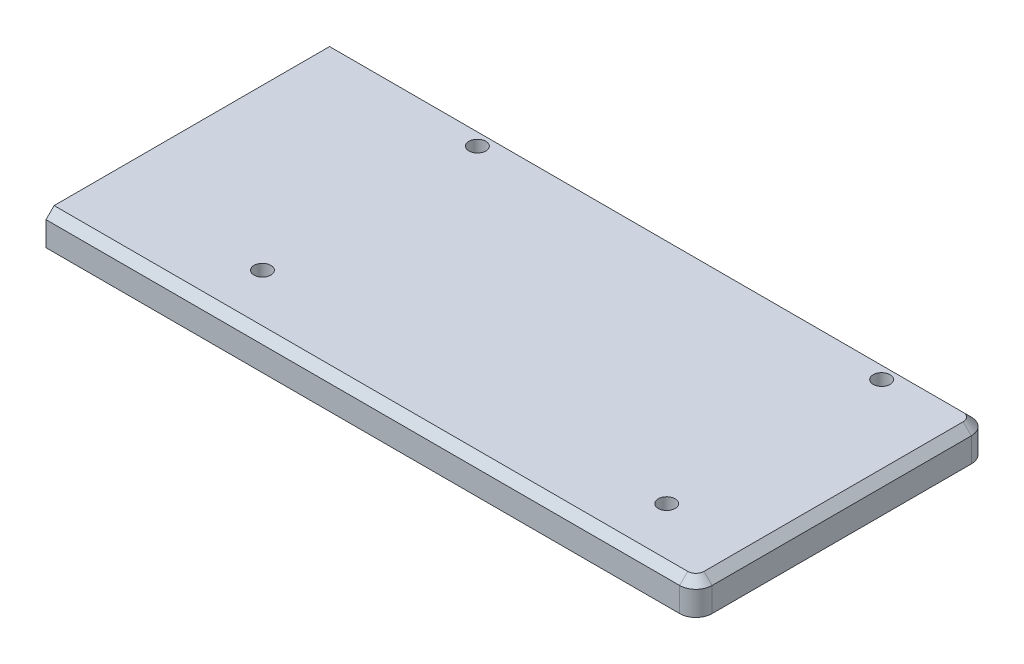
ISO-10303-21;
HEADER;
FILE_DESCRIPTION(('STEP AP214'),'2;1');
FILE_NAME('part.step','',(''),(''),'','','');
FILE_SCHEMA(('AUTOMOTIVE_DESIGN { 1 0 10303 214 1 1 1 1 }'));
ENDSEC;
DATA;
#1=APPLICATION_CONTEXT('core data for automotive mechanical design processes');
#2=APPLICATION_PROTOCOL_DEFINITION('international standard','automotive_design',2000,#1);
#3=PRODUCT_CONTEXT('',#1,'mechanical');
#4=PRODUCT('Part','Part','',(#3));
#5=PRODUCT_RELATED_PRODUCT_CATEGORY('part','',(#4));
#6=PRODUCT_DEFINITION_FORMATION('','',#4);
#7=PRODUCT_DEFINITION_CONTEXT('part definition',#1,'design');
#8=PRODUCT_DEFINITION('design','',#6,#7);
#9=PRODUCT_DEFINITION_SHAPE('','',#8);
#10=(LENGTH_UNIT() NAMED_UNIT(*) SI_UNIT(.MILLI.,.METRE.));
#11=(NAMED_UNIT(*) PLANE_ANGLE_UNIT() SI_UNIT($,.RADIAN.));
#12=(NAMED_UNIT(*) SI_UNIT($,.STERADIAN.) SOLID_ANGLE_UNIT());
#13=UNCERTAINTY_MEASURE_WITH_UNIT(LENGTH_MEASURE(1.E-05),#10,'distance_accuracy_value','');
#14=(GEOMETRIC_REPRESENTATION_CONTEXT(3) GLOBAL_UNCERTAINTY_ASSIGNED_CONTEXT((#13)) GLOBAL_UNIT_ASSIGNED_CONTEXT((#10,
#11,#12)) REPRESENTATION_CONTEXT('',''));
#15=CARTESIAN_POINT('',(0.,0.,0.));
#16=DIRECTION('',(0.,0.,1.));
#17=DIRECTION('',(1.,0.,0.));
#18=AXIS2_PLACEMENT_3D('',#15,#16,#17);
#19=CARTESIAN_POINT('',(2.63677968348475E-13,6.34999999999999,0.));
#20=DIRECTION('',(1.,0.,0.));
#21=DIRECTION('',(0.,0.,-1.));
#22=AXIS2_PLACEMENT_3D('',#19,#20,#21);
#23=PLANE('',#22);
#24=DIRECTION('',(0.,0.,1.));
#25=VECTOR('',#24,1.);
#26=CARTESIAN_POINT('',(2.63677968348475E-13,6.34999999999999,0.));
#27=LINE('',#26,#25);
#28=CARTESIAN_POINT('',(2.63677968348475E-13,6.34999999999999,-55.4101));
#29=VERTEX_POINT('',#28);
#30=CARTESIAN_POINT('',(2.63677968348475E-13,6.34999999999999,-1.58749999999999));
#31=VERTEX_POINT('',#30);
#32=EDGE_CURVE('E139',#29,#31,#27,.T.);
#33=ORIENTED_EDGE('',*,*,#32,.F.);
#34=DIRECTION('',(0.,0.707106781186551,0.707106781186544));
#35=VECTOR('',#34,1.);
#36=CARTESIAN_POINT('',(2.63677968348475E-13,6.34999999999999,-55.4101));
#37=LINE('',#36,#35);
#38=CARTESIAN_POINT('',(2.08166817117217E-13,4.76249999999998,-56.9976));
#39=VERTEX_POINT('',#38);
#40=EDGE_CURVE('E170',#29,#39,#37,.F.);
#41=ORIENTED_EDGE('',*,*,#40,.T.);
#42=DIRECTION('',(0.,-1.,0.));
#43=VECTOR('',#42,1.);
#44=CARTESIAN_POINT('',(2.63677968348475E-13,6.34999999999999,-56.9976));
#45=LINE('',#44,#43);
#46=CARTESIAN_POINT('',(0.,0.,-56.9976));
#47=VERTEX_POINT('',#46);
#48=EDGE_CURVE('E120',#39,#47,#45,.T.);
#49=ORIENTED_EDGE('',*,*,#48,.T.);
#50=DIRECTION('',(0.,0.,1.));
#51=VECTOR('',#50,1.);
#52=CARTESIAN_POINT('',(0.,0.,0.));
#53=LINE('',#52,#51);
#54=CARTESIAN_POINT('',(0.,0.,0.));
#55=VERTEX_POINT('',#54);
#56=EDGE_CURVE('E126',#47,#55,#53,.T.);
#57=ORIENTED_EDGE('',*,*,#56,.T.);
#58=DIRECTION('',(0.,-1.,0.));
#59=VECTOR('',#58,1.);
#60=CARTESIAN_POINT('',(2.63677968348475E-13,6.34999999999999,0.));
#61=LINE('',#60,#59);
#62=CARTESIAN_POINT('',(2.08166817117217E-13,4.7625,0.));
#63=VERTEX_POINT('',#62);
#64=EDGE_CURVE('E111',#63,#55,#61,.T.);
#65=ORIENTED_EDGE('',*,*,#64,.F.);
#66=DIRECTION('',(0.,-0.707106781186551,0.707106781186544));
#67=VECTOR('',#66,1.);
#68=CARTESIAN_POINT('',(2.63677968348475E-13,6.34999999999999,-1.58749999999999));
#69=LINE('',#68,#67);
#70=EDGE_CURVE('E168',#63,#31,#69,.F.);
#71=ORIENTED_EDGE('',*,*,#70,.T.);
#72=EDGE_LOOP('',(#33,#41,#49,#57,#65,#71));
#73=FACE_BOUND('',#72,.T.);
#74=ADVANCED_FACE('F38',(#73),#23,.F.);
#75=CARTESIAN_POINT('',(2.63677968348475E-13,6.34999999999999,0.));
#76=DIRECTION('',(0.,0.,-1.));
#77=DIRECTION('',(-1.,0.,0.));
#78=AXIS2_PLACEMENT_3D('',#75,#76,#77);
#79=PLANE('',#78);
#80=DIRECTION('',(0.,-1.,0.));
#81=VECTOR('',#80,1.);
#82=CARTESIAN_POINT('',(123.825,6.34999999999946,0.));
#83=LINE('',#82,#81);
#84=CARTESIAN_POINT('',(123.825,-5.34294830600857E-13,0.));
#85=VERTEX_POINT('',#84);
#86=CARTESIAN_POINT('',(123.825,4.76249999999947,0.));
#87=VERTEX_POINT('',#86);
#88=EDGE_CURVE('E155',#85,#87,#83,.F.);
#89=ORIENTED_EDGE('',*,*,#88,.T.);
#90=DIRECTION('',(-1.,0.,0.));
#91=VECTOR('',#90,1.);
#92=CARTESIAN_POINT('',(2.08166817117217E-13,4.7625,0.));
#93=LINE('',#92,#91);
#94=EDGE_CURVE('E12',#87,#63,#93,.T.);
#95=ORIENTED_EDGE('',*,*,#94,.T.);
#96=ORIENTED_EDGE('',*,*,#64,.T.);
#97=DIRECTION('',(1.,0.,0.));
#98=VECTOR('',#97,1.);
#99=CARTESIAN_POINT('',(0.,0.,0.));
#100=LINE('',#99,#98);
#101=EDGE_CURVE('E114',#55,#85,#100,.T.);
#102=ORIENTED_EDGE('',*,*,#101,.T.);
#103=EDGE_LOOP('',(#89,#95,#96,#102));
#104=FACE_BOUND('',#103,.T.);
#105=ADVANCED_FACE('F113',(#104),#79,.F.);
#106=CARTESIAN_POINT('',(127.,6.34999999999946,0.));
#107=DIRECTION('',(-1.,0.,0.));
#108=DIRECTION('',(0.,0.,1.));
#109=AXIS2_PLACEMENT_3D('',#106,#107,#108);
#110=PLANE('',#109);
#111=DIRECTION('',(0.,-1.,0.));
#112=VECTOR('',#111,1.);
#113=CARTESIAN_POINT('',(127.,6.34999999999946,-53.8226));
#114=LINE('',#113,#112);
#115=CARTESIAN_POINT('',(127.,-5.34294830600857E-13,-53.8226));
#116=VERTEX_POINT('',#115);
#117=CARTESIAN_POINT('',(127.,4.76249999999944,-53.8226));
#118=VERTEX_POINT('',#117);
#119=EDGE_CURVE('E153',#116,#118,#114,.F.);
#120=ORIENTED_EDGE('',*,*,#119,.T.);
#121=DIRECTION('',(0.,0.,1.));
#122=VECTOR('',#121,1.);
#123=CARTESIAN_POINT('',(127.,4.76249999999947,0.));
#124=LINE('',#123,#122);
#125=CARTESIAN_POINT('',(127.,4.76249999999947,-3.175));
#126=VERTEX_POINT('',#125);
#127=EDGE_CURVE('E62',#118,#126,#124,.T.);
#128=ORIENTED_EDGE('',*,*,#127,.T.);
#129=DIRECTION('',(0.,-1.,0.));
#130=VECTOR('',#129,1.);
#131=CARTESIAN_POINT('',(127.,6.34999999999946,-3.175));
#132=LINE('',#131,#130);
#133=CARTESIAN_POINT('',(127.,-5.34294830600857E-13,-3.175));
#134=VERTEX_POINT('',#133);
#135=EDGE_CURVE('E151',#126,#134,#132,.T.);
#136=ORIENTED_EDGE('',*,*,#135,.T.);
#137=DIRECTION('',(0.,0.,-1.));
#138=VECTOR('',#137,1.);
#139=CARTESIAN_POINT('',(127.,-5.34294830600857E-13,0.));
#140=LINE('',#139,#138);
#141=EDGE_CURVE('E130',#134,#116,#140,.T.);
#142=ORIENTED_EDGE('',*,*,#141,.T.);
#143=EDGE_LOOP('',(#120,#128,#136,#142));
#144=FACE_BOUND('',#143,.T.);
#145=ADVANCED_FACE('F211',(#144),#110,.F.);
#146=CARTESIAN_POINT('',(2.63677968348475E-13,6.34999999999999,-56.9976));
#147=DIRECTION('',(0.,0.,1.));
#148=DIRECTION('',(1.,0.,0.));
#149=AXIS2_PLACEMENT_3D('',#146,#147,#148);
#150=PLANE('',#149);
#151=ORIENTED_EDGE('',*,*,#48,.F.);
#152=DIRECTION('',(1.,0.,0.));
#153=VECTOR('',#152,1.);
#154=CARTESIAN_POINT('',(2.08166817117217E-13,4.76249999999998,-56.9976));
#155=LINE('',#154,#153);
#156=CARTESIAN_POINT('',(123.825,4.76249999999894,-56.9976));
#157=VERTEX_POINT('',#156);
#158=EDGE_CURVE('E172',#39,#157,#155,.T.);
#159=ORIENTED_EDGE('',*,*,#158,.T.);
#160=DIRECTION('',(0.,-1.,0.));
#161=VECTOR('',#160,1.);
#162=CARTESIAN_POINT('',(123.825,6.34999999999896,-56.9976));
#163=LINE('',#162,#161);
#164=CARTESIAN_POINT('',(123.825,-1.03389519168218E-12,-56.9976));
#165=VERTEX_POINT('',#164);
#166=EDGE_CURVE('E119',#157,#165,#163,.T.);
#167=ORIENTED_EDGE('',*,*,#166,.T.);
#168=DIRECTION('',(-1.,0.,0.));
#169=VECTOR('',#168,1.);
#170=CARTESIAN_POINT('',(0.,0.,-56.9976));
#171=LINE('',#170,#169);
#172=EDGE_CURVE('E144',#165,#47,#171,.T.);
#173=ORIENTED_EDGE('',*,*,#172,.T.);
#174=EDGE_LOOP('',(#151,#159,#167,#173));
#175=FACE_BOUND('',#174,.T.);
#176=ADVANCED_FACE('F206',(#175),#150,.F.);
#177=CARTESIAN_POINT('',(2.63677968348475E-13,6.34999999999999,0.));
#178=DIRECTION('',(0.,-1.,0.));
#179=DIRECTION('',(0.,0.,-1.));
#180=AXIS2_PLACEMENT_3D('',#177,#178,#179);
#181=PLANE('',#180);
#182=CARTESIAN_POINT('',(31.3000008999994,6.34999999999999,-52.99760038));
#183=DIRECTION('',(0.,1.,0.));
#184=DIRECTION('',(-1.,0.,0.));
#185=AXIS2_PLACEMENT_3D('',#182,#183,#184);
#186=CIRCLE('',#185,1.651);
#187=CARTESIAN_POINT('',(29.6490008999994,6.34999999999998,-52.99760038));
#188=VERTEX_POINT('',#187);
#189=EDGE_CURVE('E346',#188,#188,#186,.T.);
#190=ORIENTED_EDGE('',*,*,#189,.F.);
#191=EDGE_LOOP('',(#190));
#192=FACE_BOUND('',#191,.T.);
#193=CARTESIAN_POINT('',(31.300000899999,6.34999999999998,-10.99760056));
#194=DIRECTION('',(0.,1.,0.));
#195=DIRECTION('',(-1.,0.,0.));
#196=AXIS2_PLACEMENT_3D('',#193,#194,#195);
#197=CIRCLE('',#196,1.65100000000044);
#198=CARTESIAN_POINT('',(29.6490008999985,6.34999999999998,-10.99760056));
#199=VERTEX_POINT('',#198);
#200=EDGE_CURVE('E350',#199,#199,#197,.T.);
#201=ORIENTED_EDGE('',*,*,#200,.F.);
#202=EDGE_LOOP('',(#201));
#203=FACE_BOUND('',#202,.T.);
#204=CARTESIAN_POINT('',(110.300000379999,6.35000000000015,-10.99760056));
#205=DIRECTION('',(0.,1.,0.));
#206=DIRECTION('',(-1.,0.,0.));
#207=AXIS2_PLACEMENT_3D('',#204,#205,#206);
#208=CIRCLE('',#207,1.65100000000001);
#209=CARTESIAN_POINT('',(108.649000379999,6.35000000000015,-10.99760056));
#210=VERTEX_POINT('',#209);
#211=EDGE_CURVE('E354',#210,#210,#208,.T.);
#212=ORIENTED_EDGE('',*,*,#211,.F.);
#213=EDGE_LOOP('',(#212));
#214=FACE_BOUND('',#213,.T.);
#215=CARTESIAN_POINT('',(110.300000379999,6.35000000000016,-52.99760038));
#216=DIRECTION('',(0.,1.,0.));
#217=DIRECTION('',(-1.,0.,0.));
#218=AXIS2_PLACEMENT_3D('',#215,#216,#217);
#219=CIRCLE('',#218,1.65100000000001);
#220=CARTESIAN_POINT('',(108.649000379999,6.35000000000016,-52.99760038));
#221=VERTEX_POINT('',#220);
#222=EDGE_CURVE('E342',#221,#221,#219,.T.);
#223=ORIENTED_EDGE('',*,*,#222,.F.);
#224=EDGE_LOOP('',(#223));
#225=FACE_BOUND('',#224,.T.);
#226=CARTESIAN_POINT('',(123.825,6.34999999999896,-53.8226));
#227=DIRECTION('',(0.,-1.,0.));
#228=DIRECTION('',(0.,0.,-1.));
#229=AXIS2_PLACEMENT_3D('',#226,#227,#228);
#230=CIRCLE('',#229,1.58750000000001);
#231=CARTESIAN_POINT('',(125.4125,6.34999999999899,-53.8226));
#232=VERTEX_POINT('',#231);
#233=CARTESIAN_POINT('',(123.825,6.34999999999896,-55.4101));
#234=VERTEX_POINT('',#233);
#235=EDGE_CURVE('E163',#232,#234,#230,.F.);
#236=ORIENTED_EDGE('',*,*,#235,.T.);
#237=DIRECTION('',(-1.,0.,0.));
#238=VECTOR('',#237,1.);
#239=CARTESIAN_POINT('',(2.63677968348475E-13,6.34999999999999,-55.4101));
#240=LINE('',#239,#238);
#241=EDGE_CURVE('E165',#234,#29,#240,.T.);
#242=ORIENTED_EDGE('',*,*,#241,.T.);
#243=ORIENTED_EDGE('',*,*,#32,.T.);
#244=DIRECTION('',(1.,0.,0.));
#245=VECTOR('',#244,1.);
#246=CARTESIAN_POINT('',(2.63677968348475E-13,6.34999999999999,-1.58749999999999));
#247=LINE('',#246,#245);
#248=CARTESIAN_POINT('',(123.825,6.34999999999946,-1.58749999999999));
#249=VERTEX_POINT('',#248);
#250=EDGE_CURVE('E157',#31,#249,#247,.T.);
#251=ORIENTED_EDGE('',*,*,#250,.T.);
#252=CARTESIAN_POINT('',(123.825,6.34999999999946,-3.175));
#253=DIRECTION('',(0.,-1.,0.));
#254=DIRECTION('',(0.,0.,-1.));
#255=AXIS2_PLACEMENT_3D('',#252,#253,#254);
#256=CIRCLE('',#255,1.58750000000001);
#257=CARTESIAN_POINT('',(125.4125,6.34999999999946,-3.175));
#258=VERTEX_POINT('',#257);
#259=EDGE_CURVE('E159',#249,#258,#256,.F.);
#260=ORIENTED_EDGE('',*,*,#259,.T.);
#261=DIRECTION('',(0.,0.,-1.));
#262=VECTOR('',#261,1.);
#263=CARTESIAN_POINT('',(125.4125,6.34999999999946,0.));
#264=LINE('',#263,#262);
#265=EDGE_CURVE('E161',#258,#232,#264,.T.);
#266=ORIENTED_EDGE('',*,*,#265,.T.);
#267=EDGE_LOOP('',(#236,#242,#243,#251,#260,#266));
#268=FACE_BOUND('',#267,.T.);
#269=ADVANCED_FACE('F198',(#192,#203,#214,#225,#268),#181,.F.);
#270=CARTESIAN_POINT('',(0.,0.,0.));
#271=DIRECTION('',(0.,-1.,0.));
#272=DIRECTION('',(0.,0.,-1.));
#273=AXIS2_PLACEMENT_3D('',#270,#271,#272);
#274=PLANE('',#273);
#275=CARTESIAN_POINT('',(31.3000008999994,-1.22818422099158E-12,-52.99760038));
#276=DIRECTION('',(0.,1.,0.));
#277=DIRECTION('',(-1.,0.,0.));
#278=AXIS2_PLACEMENT_3D('',#275,#276,#277);
#279=CIRCLE('',#278,1.651);
#280=CARTESIAN_POINT('',(29.6490008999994,-1.23221453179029E-12,-52.99760038));
#281=VERTEX_POINT('',#280);
#282=EDGE_CURVE('E331',#281,#281,#279,.T.);
#283=ORIENTED_EDGE('',*,*,#282,.T.);
#284=EDGE_LOOP('',(#283));
#285=FACE_BOUND('',#284,.T.);
#286=CARTESIAN_POINT('',(31.300000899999,-1.22818422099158E-12,-10.99760056));
#287=DIRECTION('',(0.,1.,0.));
#288=DIRECTION('',(-1.,0.,0.));
#289=AXIS2_PLACEMENT_3D('',#286,#287,#288);
#290=CIRCLE('',#289,1.65100000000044);
#291=CARTESIAN_POINT('',(29.6490008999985,-1.23221453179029E-12,-10.99760056));
#292=VERTEX_POINT('',#291);
#293=EDGE_CURVE('E335',#292,#292,#290,.T.);
#294=ORIENTED_EDGE('',*,*,#293,.T.);
#295=EDGE_LOOP('',(#294));
#296=FACE_BOUND('',#295,.T.);
#297=CARTESIAN_POINT('',(110.300000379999,-1.08940634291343E-12,-10.99760056));
#298=DIRECTION('',(0.,1.,0.));
#299=DIRECTION('',(-1.,0.,0.));
#300=AXIS2_PLACEMENT_3D('',#297,#298,#299);
#301=CIRCLE('',#300,1.65100000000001);
#302=CARTESIAN_POINT('',(108.649000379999,-1.09343665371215E-12,-10.99760056));
#303=VERTEX_POINT('',#302);
#304=EDGE_CURVE('E339',#303,#303,#301,.T.);
#305=ORIENTED_EDGE('',*,*,#304,.T.);
#306=EDGE_LOOP('',(#305));
#307=FACE_BOUND('',#306,.T.);
#308=CARTESIAN_POINT('',(110.300000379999,-1.08246744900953E-12,-52.99760038));
#309=DIRECTION('',(0.,1.,0.));
#310=DIRECTION('',(-1.,0.,0.));
#311=AXIS2_PLACEMENT_3D('',#308,#309,#310);
#312=CIRCLE('',#311,1.65100000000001);
#313=CARTESIAN_POINT('',(108.649000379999,-1.08649775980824E-12,-52.99760038));
#314=VERTEX_POINT('',#313);
#315=EDGE_CURVE('E182',#314,#314,#312,.T.);
#316=ORIENTED_EDGE('',*,*,#315,.T.);
#317=EDGE_LOOP('',(#316));
#318=FACE_BOUND('',#317,.T.);
#319=ORIENTED_EDGE('',*,*,#172,.F.);
#320=CARTESIAN_POINT('',(123.825,-1.03389519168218E-12,-53.8226));
#321=DIRECTION('',(0.,-1.,0.));
#322=DIRECTION('',(0.,0.,-1.));
#323=AXIS2_PLACEMENT_3D('',#320,#321,#322);
#324=CIRCLE('',#323,3.175);
#325=EDGE_CURVE('E149',#165,#116,#324,.T.);
#326=ORIENTED_EDGE('',*,*,#325,.T.);
#327=ORIENTED_EDGE('',*,*,#141,.F.);
#328=CARTESIAN_POINT('',(123.825,-5.34294830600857E-13,-3.175));
#329=DIRECTION('',(0.,-1.,0.));
#330=DIRECTION('',(0.,0.,-1.));
#331=AXIS2_PLACEMENT_3D('',#328,#329,#330);
#332=CIRCLE('',#331,3.175);
#333=EDGE_CURVE('E129',#134,#85,#332,.T.);
#334=ORIENTED_EDGE('',*,*,#333,.T.);
#335=ORIENTED_EDGE('',*,*,#101,.F.);
#336=ORIENTED_EDGE('',*,*,#56,.F.);
#337=EDGE_LOOP('',(#319,#326,#327,#334,#335,#336));
#338=FACE_BOUND('',#337,.T.);
#339=ADVANCED_FACE('F125',(#285,#296,#307,#318,#338),#274,.T.);
#340=CARTESIAN_POINT('',(123.825,6.34999999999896,-53.8226));
#341=DIRECTION('',(0.,-1.,0.));
#342=DIRECTION('',(0.,0.,-1.));
#343=AXIS2_PLACEMENT_3D('',#340,#341,#342);
#344=CYLINDRICAL_SURFACE('',#343,3.175);
#345=ORIENTED_EDGE('',*,*,#166,.F.);
#346=CARTESIAN_POINT('',(123.825,4.76249999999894,-53.8226));
#347=DIRECTION('',(0.,-1.,0.));
#348=DIRECTION('',(0.,0.,-1.));
#349=AXIS2_PLACEMENT_3D('',#346,#347,#348);
#350=CIRCLE('',#349,3.175);
#351=EDGE_CURVE('E174',#157,#118,#350,.T.);
#352=ORIENTED_EDGE('',*,*,#351,.T.);
#353=ORIENTED_EDGE('',*,*,#119,.F.);
#354=ORIENTED_EDGE('',*,*,#325,.F.);
#355=EDGE_LOOP('',(#345,#352,#353,#354));
#356=FACE_BOUND('',#355,.T.);
#357=ADVANCED_FACE('F212',(#356),#344,.T.);
#358=CARTESIAN_POINT('',(123.825,6.34999999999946,-3.175));
#359=DIRECTION('',(0.,-1.,0.));
#360=DIRECTION('',(0.,0.,-1.));
#361=AXIS2_PLACEMENT_3D('',#358,#359,#360);
#362=CYLINDRICAL_SURFACE('',#361,3.175);
#363=ORIENTED_EDGE('',*,*,#135,.F.);
#364=CARTESIAN_POINT('',(123.825,4.76249999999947,-3.175));
#365=DIRECTION('',(0.,-1.,0.));
#366=DIRECTION('',(0.,0.,-1.));
#367=AXIS2_PLACEMENT_3D('',#364,#365,#366);
#368=CIRCLE('',#367,3.175);
#369=EDGE_CURVE('E47',#126,#87,#368,.T.);
#370=ORIENTED_EDGE('',*,*,#369,.T.);
#371=ORIENTED_EDGE('',*,*,#88,.F.);
#372=ORIENTED_EDGE('',*,*,#333,.F.);
#373=EDGE_LOOP('',(#363,#370,#371,#372));
#374=FACE_BOUND('',#373,.T.);
#375=ADVANCED_FACE('F235',(#374),#362,.T.);
#376=CARTESIAN_POINT('',(2.63677968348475E-13,6.34999999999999,-1.58749999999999));
#377=DIRECTION('',(0.,-0.707106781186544,-0.707106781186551));
#378=DIRECTION('',(1.,0.,0.));
#379=AXIS2_PLACEMENT_3D('',#376,#377,#378);
#380=PLANE('',#379);
#381=ORIENTED_EDGE('',*,*,#70,.F.);
#382=ORIENTED_EDGE('',*,*,#94,.F.);
#383=DIRECTION('',(0.,-0.707106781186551,0.707106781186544));
#384=VECTOR('',#383,1.);
#385=CARTESIAN_POINT('',(123.825,6.34999999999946,-1.58749999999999));
#386=LINE('',#385,#384);
#387=EDGE_CURVE('E42',#249,#87,#386,.T.);
#388=ORIENTED_EDGE('',*,*,#387,.F.);
#389=ORIENTED_EDGE('',*,*,#250,.F.);
#390=EDGE_LOOP('',(#381,#382,#388,#389));
#391=FACE_BOUND('',#390,.T.);
#392=ADVANCED_FACE('F40',(#391),#380,.F.);
#393=CARTESIAN_POINT('',(123.825,6.34999999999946,-3.175));
#394=DIRECTION('',(0.,-1.,0.));
#395=DIRECTION('',(0.,0.,-1.));
#396=AXIS2_PLACEMENT_3D('',#393,#394,#395);
#397=CONICAL_SURFACE('',#396,1.58750000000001,0.785398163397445);
#398=ORIENTED_EDGE('',*,*,#387,.T.);
#399=ORIENTED_EDGE('',*,*,#369,.F.);
#400=DIRECTION('',(0.707106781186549,-0.707106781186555,0.));
#401=VECTOR('',#400,1.);
#402=CARTESIAN_POINT('',(125.4125,6.34999999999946,-3.175));
#403=LINE('',#402,#401);
#404=EDGE_CURVE('E137',#258,#126,#403,.T.);
#405=ORIENTED_EDGE('',*,*,#404,.F.);
#406=ORIENTED_EDGE('',*,*,#259,.F.);
#407=EDGE_LOOP('',(#398,#399,#405,#406));
#408=FACE_BOUND('',#407,.T.);
#409=ADVANCED_FACE('F192',(#408),#397,.T.);
#410=CARTESIAN_POINT('',(125.4125,6.34999999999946,0.));
#411=DIRECTION('',(-0.707106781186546,-0.70710678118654,0.));
#412=DIRECTION('',(0.,0.,-1.));
#413=AXIS2_PLACEMENT_3D('',#410,#411,#412);
#414=PLANE('',#413);
#415=ORIENTED_EDGE('',*,*,#404,.T.);
#416=ORIENTED_EDGE('',*,*,#127,.F.);
#417=DIRECTION('',(0.707106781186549,-0.707106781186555,0.));
#418=VECTOR('',#417,1.);
#419=CARTESIAN_POINT('',(125.4125,6.34999999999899,-53.8226));
#420=LINE('',#419,#418);
#421=EDGE_CURVE('E181',#232,#118,#420,.T.);
#422=ORIENTED_EDGE('',*,*,#421,.F.);
#423=ORIENTED_EDGE('',*,*,#265,.F.);
#424=EDGE_LOOP('',(#415,#416,#422,#423));
#425=FACE_BOUND('',#424,.T.);
#426=ADVANCED_FACE('F188',(#425),#414,.F.);
#427=CARTESIAN_POINT('',(123.825,6.34999999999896,-53.8226));
#428=DIRECTION('',(0.,-1.,0.));
#429=DIRECTION('',(0.,0.,-1.));
#430=AXIS2_PLACEMENT_3D('',#427,#428,#429);
#431=CONICAL_SURFACE('',#430,1.58750000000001,0.785398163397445);
#432=ORIENTED_EDGE('',*,*,#421,.T.);
#433=ORIENTED_EDGE('',*,*,#351,.F.);
#434=DIRECTION('',(0.,-0.707106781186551,-0.707106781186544));
#435=VECTOR('',#434,1.);
#436=CARTESIAN_POINT('',(123.825,6.34999999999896,-55.4101));
#437=LINE('',#436,#435);
#438=EDGE_CURVE('E178',#234,#157,#437,.T.);
#439=ORIENTED_EDGE('',*,*,#438,.F.);
#440=ORIENTED_EDGE('',*,*,#235,.F.);
#441=EDGE_LOOP('',(#432,#433,#439,#440));
#442=FACE_BOUND('',#441,.T.);
#443=ADVANCED_FACE('F215',(#442),#431,.T.);
#444=CARTESIAN_POINT('',(2.63677968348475E-13,6.34999999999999,-55.4101));
#445=DIRECTION('',(0.,-0.707106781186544,0.707106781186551));
#446=DIRECTION('',(-1.,0.,0.));
#447=AXIS2_PLACEMENT_3D('',#444,#445,#446);
#448=PLANE('',#447);
#449=ORIENTED_EDGE('',*,*,#438,.T.);
#450=ORIENTED_EDGE('',*,*,#158,.F.);
#451=ORIENTED_EDGE('',*,*,#40,.F.);
#452=ORIENTED_EDGE('',*,*,#241,.F.);
#453=EDGE_LOOP('',(#449,#450,#451,#452));
#454=FACE_BOUND('',#453,.T.);
#455=ADVANCED_FACE('F203',(#454),#448,.F.);
#456=CARTESIAN_POINT('',(110.300000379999,-1.08246744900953E-12,-52.99760038));
#457=DIRECTION('',(0.,1.,0.));
#458=DIRECTION('',(-1.,0.,0.));
#459=AXIS2_PLACEMENT_3D('',#456,#457,#458);
#460=CYLINDRICAL_SURFACE('',#459,1.65100000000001);
#461=ORIENTED_EDGE('',*,*,#315,.F.);
#462=EDGE_LOOP('',(#461));
#463=FACE_BOUND('',#462,.T.);
#464=ORIENTED_EDGE('',*,*,#222,.T.);
#465=EDGE_LOOP('',(#464));
#466=FACE_BOUND('',#465,.T.);
#467=ADVANCED_FACE('F222',(#463,#466),#460,.F.);
#468=CARTESIAN_POINT('',(110.300000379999,-1.08940634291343E-12,-10.99760056));
#469=DIRECTION('',(0.,1.,0.));
#470=DIRECTION('',(-1.,0.,0.));
#471=AXIS2_PLACEMENT_3D('',#468,#469,#470);
#472=CYLINDRICAL_SURFACE('',#471,1.65100000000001);
#473=ORIENTED_EDGE('',*,*,#304,.F.);
#474=EDGE_LOOP('',(#473));
#475=FACE_BOUND('',#474,.T.);
#476=ORIENTED_EDGE('',*,*,#211,.T.);
#477=EDGE_LOOP('',(#476));
#478=FACE_BOUND('',#477,.T.);
#479=ADVANCED_FACE('F262',(#475,#478),#472,.F.);
#480=CARTESIAN_POINT('',(31.300000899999,-1.22818422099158E-12,-10.99760056));
#481=DIRECTION('',(0.,1.,0.));
#482=DIRECTION('',(-1.,0.,0.));
#483=AXIS2_PLACEMENT_3D('',#480,#481,#482);
#484=CYLINDRICAL_SURFACE('',#483,1.65100000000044);
#485=ORIENTED_EDGE('',*,*,#293,.F.);
#486=EDGE_LOOP('',(#485));
#487=FACE_BOUND('',#486,.T.);
#488=ORIENTED_EDGE('',*,*,#200,.T.);
#489=EDGE_LOOP('',(#488));
#490=FACE_BOUND('',#489,.T.);
#491=ADVANCED_FACE('F270',(#487,#490),#484,.F.);
#492=CARTESIAN_POINT('',(31.3000008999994,-1.22818422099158E-12,-52.99760038));
#493=DIRECTION('',(0.,1.,0.));
#494=DIRECTION('',(-1.,0.,0.));
#495=AXIS2_PLACEMENT_3D('',#492,#493,#494);
#496=CYLINDRICAL_SURFACE('',#495,1.651);
#497=ORIENTED_EDGE('',*,*,#282,.F.);
#498=EDGE_LOOP('',(#497));
#499=FACE_BOUND('',#498,.T.);
#500=ORIENTED_EDGE('',*,*,#189,.T.);
#501=EDGE_LOOP('',(#500));
#502=FACE_BOUND('',#501,.T.);
#503=ADVANCED_FACE('F278',(#499,#502),#496,.F.);
#504=CLOSED_SHELL('',(#74,#105,#145,#176,#269,#339,#357,#375,#392,#409,#426,#443,#455,#467,#479,
#491,#503));
#505=MANIFOLD_SOLID_BREP('B2',#504);
#506=ADVANCED_BREP_SHAPE_REPRESENTATION('',(#18,#505),#14);
#507=SHAPE_DEFINITION_REPRESENTATION(#9,#506);
ENDSEC;
END-ISO-10303-21;
